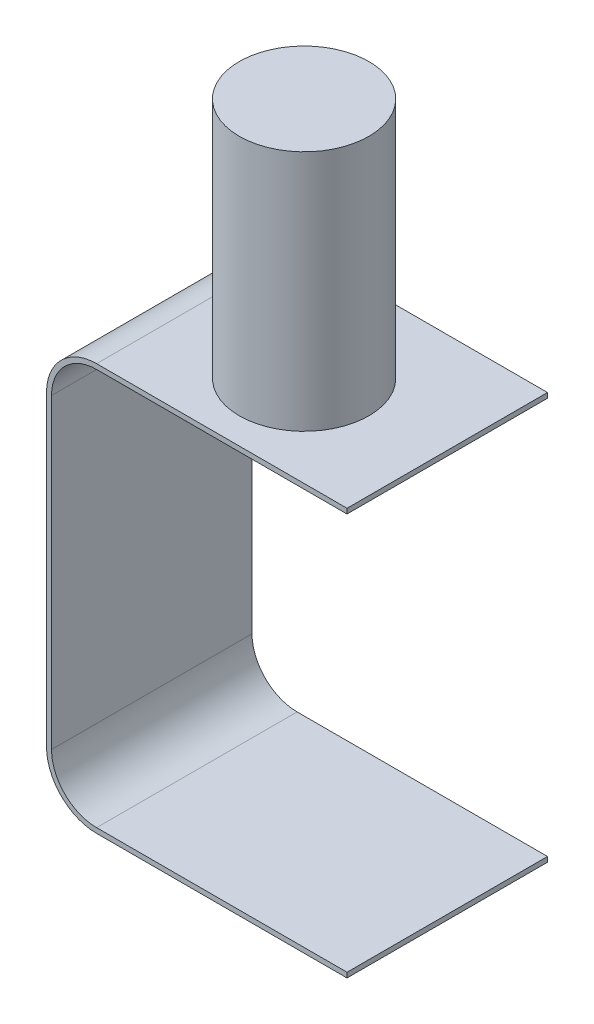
ISO-10303-21;
HEADER;
FILE_DESCRIPTION(('STEP AP214'),'2;1');
FILE_NAME('part.step','',(''),(''),'','','');
FILE_SCHEMA(('AUTOMOTIVE_DESIGN { 1 0 10303 214 1 1 1 1 }'));
ENDSEC;
DATA;
#1=APPLICATION_CONTEXT('core data for automotive mechanical design processes');
#2=APPLICATION_PROTOCOL_DEFINITION('international standard','automotive_design',2000,#1);
#3=PRODUCT_CONTEXT('',#1,'mechanical');
#4=PRODUCT('Part','Part','',(#3));
#5=PRODUCT_RELATED_PRODUCT_CATEGORY('part','',(#4));
#6=PRODUCT_DEFINITION_FORMATION('','',#4);
#7=PRODUCT_DEFINITION_CONTEXT('part definition',#1,'design');
#8=PRODUCT_DEFINITION('design','',#6,#7);
#9=PRODUCT_DEFINITION_SHAPE('','',#8);
#10=(LENGTH_UNIT() NAMED_UNIT(*) SI_UNIT(.MILLI.,.METRE.));
#11=(NAMED_UNIT(*) PLANE_ANGLE_UNIT() SI_UNIT($,.RADIAN.));
#12=(NAMED_UNIT(*) SI_UNIT($,.STERADIAN.) SOLID_ANGLE_UNIT());
#13=UNCERTAINTY_MEASURE_WITH_UNIT(LENGTH_MEASURE(1.E-05),#10,'distance_accuracy_value','');
#14=(GEOMETRIC_REPRESENTATION_CONTEXT(3) GLOBAL_UNCERTAINTY_ASSIGNED_CONTEXT((#13)) GLOBAL_UNIT_ASSIGNED_CONTEXT((#10,
#11,#12)) REPRESENTATION_CONTEXT('',''));
#15=CARTESIAN_POINT('',(0.,0.,0.));
#16=DIRECTION('',(0.,0.,1.));
#17=DIRECTION('',(1.,0.,0.));
#18=AXIS2_PLACEMENT_3D('',#15,#16,#17);
#19=CARTESIAN_POINT('',(-67.8481748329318,328.857615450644,55.5027833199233));
#20=DIRECTION('',(0.,-1.,0.));
#21=DIRECTION('',(0.,0.,-1.));
#22=AXIS2_PLACEMENT_3D('',#19,#20,#21);
#23=CYLINDRICAL_SURFACE('',#22,32.8441324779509);
#24=CARTESIAN_POINT('',(-67.8481748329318,328.857615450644,55.5027833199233));
#25=DIRECTION('',(0.,1.,0.));
#26=DIRECTION('',(0.,0.,1.));
#27=AXIS2_PLACEMENT_3D('',#24,#25,#26);
#28=CIRCLE('',#27,32.8441324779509);
#29=CARTESIAN_POINT('',(-67.8481748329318,328.857615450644,88.3469157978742));
#30=VERTEX_POINT('',#29);
#31=EDGE_CURVE('E11',#30,#30,#28,.T.);
#32=ORIENTED_EDGE('',*,*,#31,.F.);
#33=EDGE_LOOP('',(#32));
#34=FACE_BOUND('',#33,.T.);
#35=CARTESIAN_POINT('',(-67.8481748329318,206.175615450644,55.5027833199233));
#36=DIRECTION('',(0.,1.,0.));
#37=DIRECTION('',(0.,0.,1.));
#38=AXIS2_PLACEMENT_3D('',#35,#36,#37);
#39=CIRCLE('',#38,32.8441324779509);
#40=CARTESIAN_POINT('',(-67.8481748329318,206.175615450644,88.3469157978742));
#41=VERTEX_POINT('',#40);
#42=EDGE_CURVE('E44',#41,#41,#39,.T.);
#43=ORIENTED_EDGE('',*,*,#42,.T.);
#44=EDGE_LOOP('',(#43));
#45=FACE_BOUND('',#44,.T.);
#46=ADVANCED_FACE('F41',(#34,#45),#23,.T.);
#47=CARTESIAN_POINT('',(-67.8481748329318,328.857615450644,55.5027833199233));
#48=DIRECTION('',(0.,1.,0.));
#49=DIRECTION('',(0.,0.,1.));
#50=AXIS2_PLACEMENT_3D('',#47,#48,#49);
#51=PLANE('',#50);
#52=ORIENTED_EDGE('',*,*,#31,.T.);
#53=EDGE_LOOP('',(#52));
#54=FACE_BOUND('',#53,.T.);
#55=ADVANCED_FACE('F56',(#54),#51,.T.);
#56=CARTESIAN_POINT('',(-67.8481748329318,206.175615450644,55.5027833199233));
#57=DIRECTION('',(0.,1.,0.));
#58=DIRECTION('',(0.,0.,1.));
#59=AXIS2_PLACEMENT_3D('',#56,#57,#58);
#60=PLANE('',#59);
#61=ORIENTED_EDGE('',*,*,#42,.F.);
#62=EDGE_LOOP('',(#61));
#63=FACE_BOUND('',#62,.T.);
#64=ADVANCED_FACE('F54',(#63),#60,.F.);
#65=CLOSED_SHELL('',(#46,#55,#64));
#66=MANIFOLD_SOLID_BREP('B2',#65);
#67=CARTESIAN_POINT('',(-126.900580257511,203.635615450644,101.6));
#68=DIRECTION('',(0.,1.,0.));
#69=DIRECTION('',(0.,0.,1.));
#70=AXIS2_PLACEMENT_3D('',#67,#68,#69);
#71=PLANE('',#70);
#72=DIRECTION('',(1.,0.,0.));
#73=VECTOR('',#72,1.);
#74=CARTESIAN_POINT('',(-126.900580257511,203.635615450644,0.));
#75=LINE('',#74,#73);
#76=CARTESIAN_POINT('',(-126.900580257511,203.635615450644,0.));
#77=VERTEX_POINT('',#76);
#78=CARTESIAN_POINT('',(0.,203.635615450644,0.));
#79=VERTEX_POINT('',#78);
#80=EDGE_CURVE('E202',#77,#79,#75,.T.);
#81=ORIENTED_EDGE('',*,*,#80,.T.);
#82=DIRECTION('',(0.,0.,-1.));
#83=VECTOR('',#82,1.);
#84=CARTESIAN_POINT('',(0.,203.635615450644,101.6));
#85=LINE('',#84,#83);
#86=CARTESIAN_POINT('',(0.,203.635615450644,101.6));
#87=VERTEX_POINT('',#86);
#88=EDGE_CURVE('E39',#87,#79,#85,.T.);
#89=ORIENTED_EDGE('',*,*,#88,.F.);
#90=DIRECTION('',(1.,0.,0.));
#91=VECTOR('',#90,1.);
#92=CARTESIAN_POINT('',(-126.900580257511,203.635615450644,101.6));
#93=LINE('',#92,#91);
#94=CARTESIAN_POINT('',(-126.900580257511,203.635615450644,101.6));
#95=VERTEX_POINT('',#94);
#96=EDGE_CURVE('E150',#95,#87,#93,.T.);
#97=ORIENTED_EDGE('',*,*,#96,.F.);
#98=DIRECTION('',(0.,0.,-1.));
#99=VECTOR('',#98,1.);
#100=CARTESIAN_POINT('',(-126.900580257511,203.635615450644,101.6));
#101=LINE('',#100,#99);
#102=EDGE_CURVE('E198',#95,#77,#101,.T.);
#103=ORIENTED_EDGE('',*,*,#102,.T.);
#104=EDGE_LOOP('',(#81,#89,#97,#103));
#105=FACE_BOUND('',#104,.T.);
#106=ADVANCED_FACE('F82',(#105),#71,.F.);
#107=CARTESIAN_POINT('',(0.,206.175615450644,101.6));
#108=DIRECTION('',(1.,0.,0.));
#109=DIRECTION('',(0.,0.,-1.));
#110=AXIS2_PLACEMENT_3D('',#107,#108,#109);
#111=PLANE('',#110);
#112=DIRECTION('',(0.,-1.,0.));
#113=VECTOR('',#112,1.);
#114=CARTESIAN_POINT('',(0.,206.175615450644,0.));
#115=LINE('',#114,#113);
#116=CARTESIAN_POINT('',(0.,206.175615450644,0.));
#117=VERTEX_POINT('',#116);
#118=EDGE_CURVE('E205',#117,#79,#115,.T.);
#119=ORIENTED_EDGE('',*,*,#118,.F.);
#120=DIRECTION('',(0.,0.,-1.));
#121=VECTOR('',#120,1.);
#122=CARTESIAN_POINT('',(0.,206.175615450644,101.6));
#123=LINE('',#122,#121);
#124=CARTESIAN_POINT('',(0.,206.175615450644,101.6));
#125=VERTEX_POINT('',#124);
#126=EDGE_CURVE('E90',#125,#117,#123,.T.);
#127=ORIENTED_EDGE('',*,*,#126,.F.);
#128=DIRECTION('',(0.,-1.,0.));
#129=VECTOR('',#128,1.);
#130=CARTESIAN_POINT('',(0.,206.175615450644,101.6));
#131=LINE('',#130,#129);
#132=EDGE_CURVE('E267',#125,#87,#131,.T.);
#133=ORIENTED_EDGE('',*,*,#132,.T.);
#134=ORIENTED_EDGE('',*,*,#88,.T.);
#135=EDGE_LOOP('',(#119,#127,#133,#134));
#136=FACE_BOUND('',#135,.T.);
#137=ADVANCED_FACE('F254',(#136),#111,.T.);
#138=CARTESIAN_POINT('',(-126.900580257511,206.175615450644,101.6));
#139=DIRECTION('',(0.,1.,0.));
#140=DIRECTION('',(0.,0.,1.));
#141=AXIS2_PLACEMENT_3D('',#138,#139,#140);
#142=PLANE('',#141);
#143=DIRECTION('',(1.,0.,0.));
#144=VECTOR('',#143,1.);
#145=CARTESIAN_POINT('',(-126.900580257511,206.175615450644,0.));
#146=LINE('',#145,#144);
#147=CARTESIAN_POINT('',(-126.900580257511,206.175615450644,0.));
#148=VERTEX_POINT('',#147);
#149=EDGE_CURVE('E208',#148,#117,#146,.T.);
#150=ORIENTED_EDGE('',*,*,#149,.F.);
#151=DIRECTION('',(0.,0.,-1.));
#152=VECTOR('',#151,1.);
#153=CARTESIAN_POINT('',(-126.900580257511,206.175615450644,101.6));
#154=LINE('',#153,#152);
#155=CARTESIAN_POINT('',(-126.900580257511,206.175615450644,101.6));
#156=VERTEX_POINT('',#155);
#157=EDGE_CURVE('E244',#156,#148,#154,.T.);
#158=ORIENTED_EDGE('',*,*,#157,.F.);
#159=DIRECTION('',(1.,0.,0.));
#160=VECTOR('',#159,1.);
#161=CARTESIAN_POINT('',(-126.900580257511,206.175615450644,101.6));
#162=LINE('',#161,#160);
#163=EDGE_CURVE('E251',#156,#125,#162,.T.);
#164=ORIENTED_EDGE('',*,*,#163,.T.);
#165=ORIENTED_EDGE('',*,*,#126,.T.);
#166=EDGE_LOOP('',(#150,#158,#164,#165));
#167=FACE_BOUND('',#166,.T.);
#168=ADVANCED_FACE('F249',(#167),#142,.T.);
#169=CARTESIAN_POINT('',(-126.900580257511,180.775615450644,101.6));
#170=DIRECTION('',(0.,0.,-1.));
#171=DIRECTION('',(-1.,0.,0.));
#172=AXIS2_PLACEMENT_3D('',#169,#170,#171);
#173=CYLINDRICAL_SURFACE('',#172,25.4);
#174=CARTESIAN_POINT('',(-126.900580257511,180.775615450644,0.));
#175=DIRECTION('',(0.,0.,-1.));
#176=DIRECTION('',(-1.,0.,0.));
#177=AXIS2_PLACEMENT_3D('',#174,#175,#176);
#178=CIRCLE('',#177,25.4);
#179=CARTESIAN_POINT('',(-152.300580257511,180.775615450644,0.));
#180=VERTEX_POINT('',#179);
#181=EDGE_CURVE('E211',#180,#148,#178,.T.);
#182=ORIENTED_EDGE('',*,*,#181,.F.);
#183=DIRECTION('',(0.,0.,-1.));
#184=VECTOR('',#183,1.);
#185=CARTESIAN_POINT('',(-152.300580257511,180.775615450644,101.6));
#186=LINE('',#185,#184);
#187=CARTESIAN_POINT('',(-152.300580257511,180.775615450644,101.6));
#188=VERTEX_POINT('',#187);
#189=EDGE_CURVE('E242',#188,#180,#186,.T.);
#190=ORIENTED_EDGE('',*,*,#189,.F.);
#191=CARTESIAN_POINT('',(-126.900580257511,180.775615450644,101.6));
#192=DIRECTION('',(0.,0.,-1.));
#193=DIRECTION('',(-1.,0.,0.));
#194=AXIS2_PLACEMENT_3D('',#191,#192,#193);
#195=CIRCLE('',#194,25.4);
#196=EDGE_CURVE('E264',#188,#156,#195,.T.);
#197=ORIENTED_EDGE('',*,*,#196,.T.);
#198=ORIENTED_EDGE('',*,*,#157,.T.);
#199=EDGE_LOOP('',(#182,#190,#197,#198));
#200=FACE_BOUND('',#199,.T.);
#201=ADVANCED_FACE('F261',(#200),#173,.T.);
#202=CARTESIAN_POINT('',(-152.300580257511,25.4,101.6));
#203=DIRECTION('',(-1.,0.,0.));
#204=DIRECTION('',(0.,0.,1.));
#205=AXIS2_PLACEMENT_3D('',#202,#203,#204);
#206=PLANE('',#205);
#207=DIRECTION('',(0.,1.,0.));
#208=VECTOR('',#207,1.);
#209=CARTESIAN_POINT('',(-152.300580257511,25.4,0.));
#210=LINE('',#209,#208);
#211=CARTESIAN_POINT('',(-152.300580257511,25.4,0.));
#212=VERTEX_POINT('',#211);
#213=EDGE_CURVE('E214',#212,#180,#210,.T.);
#214=ORIENTED_EDGE('',*,*,#213,.F.);
#215=DIRECTION('',(0.,0.,-1.));
#216=VECTOR('',#215,1.);
#217=CARTESIAN_POINT('',(-152.300580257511,25.4,101.6));
#218=LINE('',#217,#216);
#219=CARTESIAN_POINT('',(-152.300580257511,25.4,101.6));
#220=VERTEX_POINT('',#219);
#221=EDGE_CURVE('E240',#220,#212,#218,.T.);
#222=ORIENTED_EDGE('',*,*,#221,.F.);
#223=DIRECTION('',(0.,1.,0.));
#224=VECTOR('',#223,1.);
#225=CARTESIAN_POINT('',(-152.300580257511,25.4,101.6));
#226=LINE('',#225,#224);
#227=EDGE_CURVE('E269',#220,#188,#226,.T.);
#228=ORIENTED_EDGE('',*,*,#227,.T.);
#229=ORIENTED_EDGE('',*,*,#189,.T.);
#230=EDGE_LOOP('',(#214,#222,#228,#229));
#231=FACE_BOUND('',#230,.T.);
#232=ADVANCED_FACE('F369',(#231),#206,.T.);
#233=CARTESIAN_POINT('',(-126.900580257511,25.4,101.6));
#234=DIRECTION('',(0.,0.,-1.));
#235=DIRECTION('',(-1.,0.,0.));
#236=AXIS2_PLACEMENT_3D('',#233,#234,#235);
#237=CYLINDRICAL_SURFACE('',#236,25.4);
#238=CARTESIAN_POINT('',(-126.900580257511,25.4,0.));
#239=DIRECTION('',(0.,0.,-1.));
#240=DIRECTION('',(-1.,0.,0.));
#241=AXIS2_PLACEMENT_3D('',#238,#239,#240);
#242=CIRCLE('',#241,25.4);
#243=CARTESIAN_POINT('',(-126.900580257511,0.,0.));
#244=VERTEX_POINT('',#243);
#245=EDGE_CURVE('E217',#244,#212,#242,.T.);
#246=ORIENTED_EDGE('',*,*,#245,.F.);
#247=DIRECTION('',(0.,0.,-1.));
#248=VECTOR('',#247,1.);
#249=CARTESIAN_POINT('',(-126.900580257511,0.,101.6));
#250=LINE('',#249,#248);
#251=CARTESIAN_POINT('',(-126.900580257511,0.,101.6));
#252=VERTEX_POINT('',#251);
#253=EDGE_CURVE('E238',#252,#244,#250,.T.);
#254=ORIENTED_EDGE('',*,*,#253,.F.);
#255=CARTESIAN_POINT('',(-126.900580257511,25.4,101.6));
#256=DIRECTION('',(0.,0.,-1.));
#257=DIRECTION('',(-1.,0.,0.));
#258=AXIS2_PLACEMENT_3D('',#255,#256,#257);
#259=CIRCLE('',#258,25.4);
#260=EDGE_CURVE('E275',#252,#220,#259,.T.);
#261=ORIENTED_EDGE('',*,*,#260,.T.);
#262=ORIENTED_EDGE('',*,*,#221,.T.);
#263=EDGE_LOOP('',(#246,#254,#261,#262));
#264=FACE_BOUND('',#263,.T.);
#265=ADVANCED_FACE('F360',(#264),#237,.T.);
#266=CARTESIAN_POINT('',(0.,0.,101.6));
#267=DIRECTION('',(0.,-1.,0.));
#268=DIRECTION('',(0.,0.,-1.));
#269=AXIS2_PLACEMENT_3D('',#266,#267,#268);
#270=PLANE('',#269);
#271=DIRECTION('',(-1.,0.,0.));
#272=VECTOR('',#271,1.);
#273=CARTESIAN_POINT('',(0.,0.,0.));
#274=LINE('',#273,#272);
#275=CARTESIAN_POINT('',(0.,0.,0.));
#276=VERTEX_POINT('',#275);
#277=EDGE_CURVE('E220',#276,#244,#274,.T.);
#278=ORIENTED_EDGE('',*,*,#277,.F.);
#279=DIRECTION('',(0.,0.,-1.));
#280=VECTOR('',#279,1.);
#281=CARTESIAN_POINT('',(0.,0.,101.6));
#282=LINE('',#281,#280);
#283=CARTESIAN_POINT('',(0.,0.,101.6));
#284=VERTEX_POINT('',#283);
#285=EDGE_CURVE('E236',#284,#276,#282,.T.);
#286=ORIENTED_EDGE('',*,*,#285,.F.);
#287=DIRECTION('',(-1.,0.,0.));
#288=VECTOR('',#287,1.);
#289=CARTESIAN_POINT('',(0.,0.,101.6));
#290=LINE('',#289,#288);
#291=EDGE_CURVE('E278',#284,#252,#290,.T.);
#292=ORIENTED_EDGE('',*,*,#291,.T.);
#293=ORIENTED_EDGE('',*,*,#253,.T.);
#294=EDGE_LOOP('',(#278,#286,#292,#293));
#295=FACE_BOUND('',#294,.T.);
#296=ADVANCED_FACE('F290',(#295),#270,.T.);
#297=CARTESIAN_POINT('',(0.,2.54,101.6));
#298=DIRECTION('',(1.,0.,0.));
#299=DIRECTION('',(0.,0.,-1.));
#300=AXIS2_PLACEMENT_3D('',#297,#298,#299);
#301=PLANE('',#300);
#302=DIRECTION('',(0.,-1.,0.));
#303=VECTOR('',#302,1.);
#304=CARTESIAN_POINT('',(0.,2.54,0.));
#305=LINE('',#304,#303);
#306=CARTESIAN_POINT('',(0.,2.54,0.));
#307=VERTEX_POINT('',#306);
#308=EDGE_CURVE('E223',#307,#276,#305,.T.);
#309=ORIENTED_EDGE('',*,*,#308,.F.);
#310=DIRECTION('',(0.,0.,-1.));
#311=VECTOR('',#310,1.);
#312=CARTESIAN_POINT('',(0.,2.54,101.6));
#313=LINE('',#312,#311);
#314=CARTESIAN_POINT('',(0.,2.54,101.6));
#315=VERTEX_POINT('',#314);
#316=EDGE_CURVE('E234',#315,#307,#313,.T.);
#317=ORIENTED_EDGE('',*,*,#316,.F.);
#318=DIRECTION('',(0.,-1.,0.));
#319=VECTOR('',#318,1.);
#320=CARTESIAN_POINT('',(0.,2.54,101.6));
#321=LINE('',#320,#319);
#322=EDGE_CURVE('E281',#315,#284,#321,.T.);
#323=ORIENTED_EDGE('',*,*,#322,.T.);
#324=ORIENTED_EDGE('',*,*,#285,.T.);
#325=EDGE_LOOP('',(#309,#317,#323,#324));
#326=FACE_BOUND('',#325,.T.);
#327=ADVANCED_FACE('F285',(#326),#301,.T.);
#328=CARTESIAN_POINT('',(0.,2.54,101.6));
#329=DIRECTION('',(0.,-1.,0.));
#330=DIRECTION('',(0.,0.,-1.));
#331=AXIS2_PLACEMENT_3D('',#328,#329,#330);
#332=PLANE('',#331);
#333=DIRECTION('',(1.,0.,0.));
#334=VECTOR('',#333,1.);
#335=CARTESIAN_POINT('',(0.,2.54,0.));
#336=LINE('',#335,#334);
#337=CARTESIAN_POINT('',(-126.900580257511,2.53999999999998,0.));
#338=VERTEX_POINT('',#337);
#339=EDGE_CURVE('E226',#307,#338,#336,.F.);
#340=ORIENTED_EDGE('',*,*,#339,.T.);
#341=DIRECTION('',(0.,0.,-1.));
#342=VECTOR('',#341,1.);
#343=CARTESIAN_POINT('',(-126.900580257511,2.53999999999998,101.6));
#344=LINE('',#343,#342);
#345=CARTESIAN_POINT('',(-126.900580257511,2.53999999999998,101.6));
#346=VERTEX_POINT('',#345);
#347=EDGE_CURVE('E193',#346,#338,#344,.T.);
#348=ORIENTED_EDGE('',*,*,#347,.F.);
#349=DIRECTION('',(1.,0.,0.));
#350=VECTOR('',#349,1.);
#351=CARTESIAN_POINT('',(0.,2.54,101.6));
#352=LINE('',#351,#350);
#353=EDGE_CURVE('E184',#315,#346,#352,.F.);
#354=ORIENTED_EDGE('',*,*,#353,.F.);
#355=ORIENTED_EDGE('',*,*,#316,.T.);
#356=EDGE_LOOP('',(#340,#348,#354,#355));
#357=FACE_BOUND('',#356,.T.);
#358=ADVANCED_FACE('F294',(#357),#332,.F.);
#359=CARTESIAN_POINT('',(-126.900580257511,25.4,101.6));
#360=DIRECTION('',(0.,0.,-1.));
#361=DIRECTION('',(-1.,0.,0.));
#362=AXIS2_PLACEMENT_3D('',#359,#360,#361);
#363=CYLINDRICAL_SURFACE('',#362,22.86);
#364=CARTESIAN_POINT('',(-126.900580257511,25.4,0.));
#365=DIRECTION('',(0.,0.,1.));
#366=DIRECTION('',(1.,0.,0.));
#367=AXIS2_PLACEMENT_3D('',#364,#365,#366);
#368=CIRCLE('',#367,22.86);
#369=CARTESIAN_POINT('',(-149.760580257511,25.4,0.));
#370=VERTEX_POINT('',#369);
#371=EDGE_CURVE('E192',#338,#370,#368,.F.);
#372=ORIENTED_EDGE('',*,*,#371,.T.);
#373=DIRECTION('',(0.,0.,-1.));
#374=VECTOR('',#373,1.);
#375=CARTESIAN_POINT('',(-149.760580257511,25.4,101.6));
#376=LINE('',#375,#374);
#377=CARTESIAN_POINT('',(-149.760580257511,25.4,101.6));
#378=VERTEX_POINT('',#377);
#379=EDGE_CURVE('E189',#378,#370,#376,.T.);
#380=ORIENTED_EDGE('',*,*,#379,.F.);
#381=CARTESIAN_POINT('',(-126.900580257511,25.4,101.6));
#382=DIRECTION('',(0.,0.,1.));
#383=DIRECTION('',(1.,0.,0.));
#384=AXIS2_PLACEMENT_3D('',#381,#382,#383);
#385=CIRCLE('',#384,22.86);
#386=EDGE_CURVE('E177',#346,#378,#385,.F.);
#387=ORIENTED_EDGE('',*,*,#386,.F.);
#388=ORIENTED_EDGE('',*,*,#347,.T.);
#389=EDGE_LOOP('',(#372,#380,#387,#388));
#390=FACE_BOUND('',#389,.T.);
#391=ADVANCED_FACE('F190',(#390),#363,.F.);
#392=CARTESIAN_POINT('',(-149.760580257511,25.4,101.6));
#393=DIRECTION('',(-1.,0.,0.));
#394=DIRECTION('',(0.,0.,1.));
#395=AXIS2_PLACEMENT_3D('',#392,#393,#394);
#396=PLANE('',#395);
#397=DIRECTION('',(0.,1.,0.));
#398=VECTOR('',#397,1.);
#399=CARTESIAN_POINT('',(-149.760580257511,25.4,0.));
#400=LINE('',#399,#398);
#401=CARTESIAN_POINT('',(-149.760580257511,180.775615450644,0.));
#402=VERTEX_POINT('',#401);
#403=EDGE_CURVE('E138',#370,#402,#400,.T.);
#404=ORIENTED_EDGE('',*,*,#403,.T.);
#405=DIRECTION('',(0.,0.,-1.));
#406=VECTOR('',#405,1.);
#407=CARTESIAN_POINT('',(-149.760580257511,180.775615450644,101.6));
#408=LINE('',#407,#406);
#409=CARTESIAN_POINT('',(-149.760580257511,180.775615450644,101.6));
#410=VERTEX_POINT('',#409);
#411=EDGE_CURVE('E194',#410,#402,#408,.T.);
#412=ORIENTED_EDGE('',*,*,#411,.F.);
#413=DIRECTION('',(0.,1.,0.));
#414=VECTOR('',#413,1.);
#415=CARTESIAN_POINT('',(-149.760580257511,25.4,101.6));
#416=LINE('',#415,#414);
#417=EDGE_CURVE('E181',#378,#410,#416,.T.);
#418=ORIENTED_EDGE('',*,*,#417,.F.);
#419=ORIENTED_EDGE('',*,*,#379,.T.);
#420=EDGE_LOOP('',(#404,#412,#418,#419));
#421=FACE_BOUND('',#420,.T.);
#422=ADVANCED_FACE('F196',(#421),#396,.F.);
#423=CARTESIAN_POINT('',(-126.900580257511,180.775615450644,101.6));
#424=DIRECTION('',(0.,0.,-1.));
#425=DIRECTION('',(-1.,0.,0.));
#426=AXIS2_PLACEMENT_3D('',#423,#424,#425);
#427=CYLINDRICAL_SURFACE('',#426,22.86);
#428=CARTESIAN_POINT('',(-126.900580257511,180.775615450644,0.));
#429=DIRECTION('',(0.,0.,1.));
#430=DIRECTION('',(1.,0.,0.));
#431=AXIS2_PLACEMENT_3D('',#428,#429,#430);
#432=CIRCLE('',#431,22.86);
#433=EDGE_CURVE('E144',#402,#77,#432,.F.);
#434=ORIENTED_EDGE('',*,*,#433,.T.);
#435=ORIENTED_EDGE('',*,*,#102,.F.);
#436=CARTESIAN_POINT('',(-126.900580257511,180.775615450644,101.6));
#437=DIRECTION('',(0.,0.,1.));
#438=DIRECTION('',(1.,0.,0.));
#439=AXIS2_PLACEMENT_3D('',#436,#437,#438);
#440=CIRCLE('',#439,22.86);
#441=EDGE_CURVE('E98',#410,#95,#440,.F.);
#442=ORIENTED_EDGE('',*,*,#441,.F.);
#443=ORIENTED_EDGE('',*,*,#411,.T.);
#444=EDGE_LOOP('',(#434,#435,#442,#443));
#445=FACE_BOUND('',#444,.T.);
#446=ADVANCED_FACE('F308',(#445),#427,.F.);
#447=CARTESIAN_POINT('',(-126.900580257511,180.775615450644,101.6));
#448=DIRECTION('',(0.,0.,-1.));
#449=DIRECTION('',(-1.,0.,0.));
#450=AXIS2_PLACEMENT_3D('',#447,#448,#449);
#451=PLANE('',#450);
#452=ORIENTED_EDGE('',*,*,#96,.T.);
#453=ORIENTED_EDGE('',*,*,#132,.F.);
#454=ORIENTED_EDGE('',*,*,#163,.F.);
#455=ORIENTED_EDGE('',*,*,#196,.F.);
#456=ORIENTED_EDGE('',*,*,#227,.F.);
#457=ORIENTED_EDGE('',*,*,#260,.F.);
#458=ORIENTED_EDGE('',*,*,#291,.F.);
#459=ORIENTED_EDGE('',*,*,#322,.F.);
#460=ORIENTED_EDGE('',*,*,#353,.T.);
#461=ORIENTED_EDGE('',*,*,#386,.T.);
#462=ORIENTED_EDGE('',*,*,#417,.T.);
#463=ORIENTED_EDGE('',*,*,#441,.T.);
#464=EDGE_LOOP('',(#452,#453,#454,#455,#456,#457,#458,#459,#460,#461,#462,#463));
#465=FACE_BOUND('',#464,.T.);
#466=ADVANCED_FACE('F179',(#465),#451,.F.);
#467=CARTESIAN_POINT('',(-126.900580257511,180.775615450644,0.));
#468=DIRECTION('',(0.,0.,-1.));
#469=DIRECTION('',(-1.,0.,0.));
#470=AXIS2_PLACEMENT_3D('',#467,#468,#469);
#471=PLANE('',#470);
#472=ORIENTED_EDGE('',*,*,#80,.F.);
#473=ORIENTED_EDGE('',*,*,#433,.F.);
#474=ORIENTED_EDGE('',*,*,#403,.F.);
#475=ORIENTED_EDGE('',*,*,#371,.F.);
#476=ORIENTED_EDGE('',*,*,#339,.F.);
#477=ORIENTED_EDGE('',*,*,#308,.T.);
#478=ORIENTED_EDGE('',*,*,#277,.T.);
#479=ORIENTED_EDGE('',*,*,#245,.T.);
#480=ORIENTED_EDGE('',*,*,#213,.T.);
#481=ORIENTED_EDGE('',*,*,#181,.T.);
#482=ORIENTED_EDGE('',*,*,#149,.T.);
#483=ORIENTED_EDGE('',*,*,#118,.T.);
#484=EDGE_LOOP('',(#472,#473,#474,#475,#476,#477,#478,#479,#480,#481,#482,#483));
#485=FACE_BOUND('',#484,.T.);
#486=ADVANCED_FACE('F257',(#485),#471,.T.);
#487=CLOSED_SHELL('',(#106,#137,#168,#201,#232,#265,#296,#327,#358,#391,#422,#446,#466,#486));
#488=MANIFOLD_SOLID_BREP('B6',#487);
#489=ADVANCED_BREP_SHAPE_REPRESENTATION('',(#18,#66,#488),#14);
#490=SHAPE_DEFINITION_REPRESENTATION(#9,#489);
ENDSEC;
END-ISO-10303-21;
